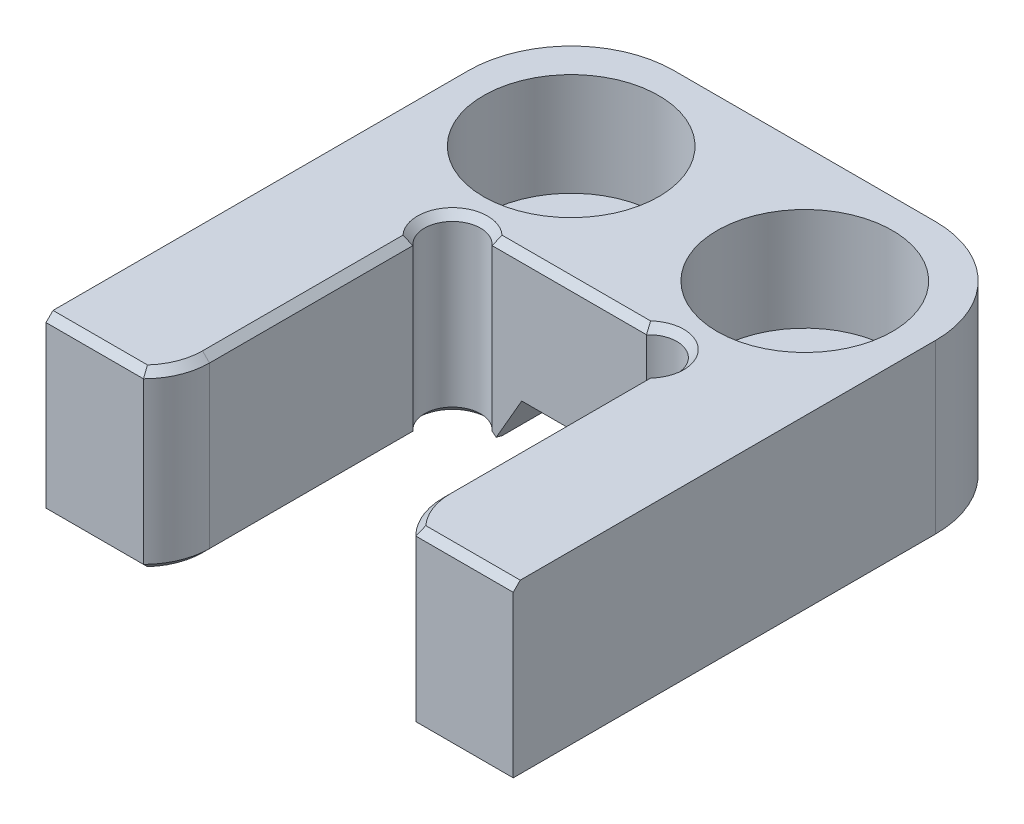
from build123d import *

# Parameters (mm, degrees)
BOSS_EXTRUDE1_DEPTH    = 9.4996
FILLET1_R              = 5.588
CUT_EXTRUDE1_DEPTH     = 33.659027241
SKETCH3_R              = 1.524
CUT_EXTRUDE2_DEPTH     = 33.659027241
CUT_EXTRUDE3_DEPTH     = 33.659027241
CHAMFER1_SIZE          = 0.381
CHAMFER5_SIZE          = 3.81
CHAMFER5_SIZE2         = 1.020886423
F_10_CBORE_D           = 5.1054
F_10_CBORE_CBORE_D     = 9.525
F_10_CBORE_CBORE_DEPTH = 5.588


with BuildPart() as part:
    # Sketch1 → Boss-Extrude1 (new body)
    with BuildSketch(Plane(origin=(0, 0, 0), x_dir=(1, 0, 0), z_dir=(0, 1, 0))):
        Polygon((6.35, 0), (12.7, 0), (12.7, 28.5496), (-12.7, 28.5496), (-12.7, 0), (-6.35, 0), (-6.35, 15.748), (6.35, 15.748), align=None)
    extrude(amount=-BOSS_EXTRUDE1_DEPTH)

    # Fillet1
    fillet1_edges = [part.edges().sort_by_distance(p)[0] for p in [
        (-12.7, -4.7498, -28.5496),
        (12.7, -4.7498, -28.5496),
    ]]
    fillet(fillet1_edges, radius=FILLET1_R)

    # Sketch2 → Cut-Extrude1 (cut, through all)
    with BuildSketch(Plane(origin=(0, 0, 0), x_dir=(1, 0, 0), z_dir=(0, 1, 0))):
        with BuildLine():
            Line((-6.35, 2.54), (-6.35, 12.7))
            Line((-6.35, 12.7), (6.35, 12.7))
            Line((6.35, 12.7), (6.35, 2.54))
            ThreePointArc((6.35, 2.54), (6.623518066, 1.165303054), (7.402409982, 0))
            Line((7.402409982, 0), (12.7, 0))
            Line((12.7, 0), (12.7, -12.7))
            Line((12.7, -12.7), (-12.7, -12.7))
            Line((-12.7, -12.7), (-12.7, 0))
            Line((-12.7, 0), (-7.402409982, 0))
            ThreePointArc((-7.402409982, 0), (-6.623518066, 1.165303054), (-6.35, 2.54))
        make_face()
    extrude(amount=-CUT_EXTRUDE1_DEPTH, mode=Mode.SUBTRACT)

    # Sketch3 → Cut-Extrude2 (cut, through all)
    with BuildSketch(Plane(origin=(0, 0, 0), x_dir=(1, 0, 0), z_dir=(0, 1, 0))):
        with Locations((-5.334, 14.732)):
            Circle(SKETCH3_R)
        with Locations((5.334, 14.732)):
            Circle(SKETCH3_R)
    extrude(amount=-CUT_EXTRUDE2_DEPTH, mode=Mode.SUBTRACT)

    # Sketch5 → Cut-Extrude3 (cut, through all)
    with BuildSketch(Plane(origin=(0, 0, -28.5496), x_dir=(-1, 0, 0), z_dir=(0, 0, -1))):
        Polygon((-3.175, -7.9121), (3.175, -7.9121), (4.091543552, -9.4996), (-4.091543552, -9.4996), align=None)
    extrude(amount=-CUT_EXTRUDE3_DEPTH, mode=Mode.SUBTRACT)

    # Chamfer1
    chamfer1_edges = [part.edges().sort_by_distance(p)[0] for p in [
        (-3.633271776, -8.70585, -28.5496),
        (0, -7.9121, -28.5496),
        (3.633271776, -8.70585, -28.5496),
        (5.601771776, -9.4996, -28.5496),
        (11.063312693, -9.4996, -26.912912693),
        (12.7, -9.4996, -11.4808),
        (10.051204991, -9.4996, 0),
        (6.623518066, -9.4996, -1.165303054),
        (6.35, -9.4996, -8.068038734),
        (6.411630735, -9.4996, -15.809630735),
        (-5.601771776, -9.4996, -28.5496),
        (-11.063312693, -9.4996, -26.912912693),
        (-12.7, -9.4996, -11.4808),
        (-6.411630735, -9.4996, -15.809630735),
        (-6.35, -9.4996, -8.068038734),
        (-6.623518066, -9.4996, -1.165303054),
        (-10.051204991, -9.4996, 0),
        (10.051204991, 0, 0),
        (6.623518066, 0, -1.165303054),
        (6.35, 0, -8.068038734),
        (6.411630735, 0, -15.809630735),
        (0, 0, -15.748),
        (-6.411630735, 0, -15.809630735),
        (-6.35, 0, -8.068038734),
        (-6.623518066, 0, -1.165303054),
        (-10.051204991, 0, 0),
    ]]
    chamfer(chamfer1_edges, length=CHAMFER1_SIZE)

    # Chamfer5
    chamfer5_edges = [part.edges().sort_by_distance(p)[0] for p in [
        (0, -7.9121, -15.748),
    ]]
    chamfer5_side = [part.faces().sort_by_distance(p)[0] for p in [
        (0, -7.9121, -21.9583),
    ]]
    chamfer(chamfer5_edges, length=CHAMFER5_SIZE, length2=CHAMFER5_SIZE2, reference=chamfer5_side[0])

    # 10 CBORE (through all)
    with Locations(Plane(origin=(9.083120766, 0, -5.226040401), x_dir=(-1, 0, 0), z_dir=(0, 1, 0))):
        with Locations((15.433120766, -16.973559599), (2.733120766, -16.973559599)):
            CounterBoreHole(F_10_CBORE_D / 2, F_10_CBORE_CBORE_D / 2, F_10_CBORE_CBORE_DEPTH)


solid = part.part
